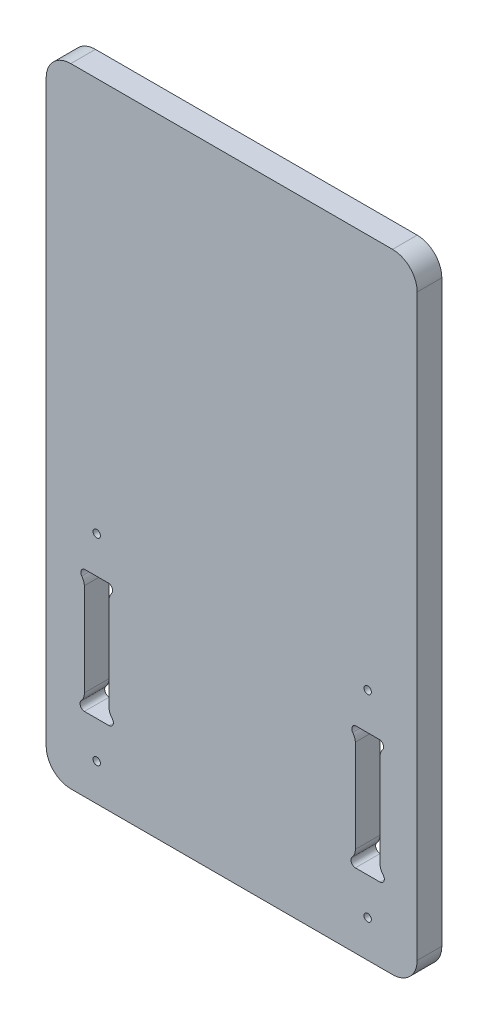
from build123d import *

# Parameters (mm, degrees)
ESQUISSE1_R        = 1.5
BOSS_EXTRU_1_DEPTH = 10
CHANFREIN1_SIZE    = 2.2


with BuildPart() as part:
    # Esquisse1 → Boss.-Extru.1 (new body)
    with BuildSketch(Plane.XY):
        with BuildLine():
            Line((-65.510099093, -55), (65.102145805, -55))
            ThreePointArc((65.102145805, -55), (72.173213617, -52.071067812), (75.102145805, -45))
            Line((75.102145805, -45), (75.102145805, 190))
            ThreePointArc((75.102145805, 190), (72.173213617, 197.071067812), (65.102145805, 200))
            Line((65.102145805, 200), (-65.510099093, 200))
            ThreePointArc((-65.510099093, 200), (-72.581166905, 197.071067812), (-75.510099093, 190))
            Line((-75.510099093, 190), (-75.510099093, -45))
            ThreePointArc((-75.510099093, -45), (-72.581166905, -52.071067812), (-65.510099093, -55))
        make_face()
        with Locations((-55, -40)):
            Circle(ESQUISSE1_R, mode=Mode.SUBTRACT)
        with Locations(Location((-55, 40, 0), (0, 0, 180))):
            Circle(ESQUISSE1_R, mode=Mode.SUBTRACT)
        with Locations(Location((55, -40, 0), (0, 0, 180))):
            Circle(ESQUISSE1_R, mode=Mode.SUBTRACT)
        with Locations((55, 40)):
            Circle(ESQUISSE1_R, mode=Mode.SUBTRACT)
        with BuildLine():
            Line((-50, -25), (-60, -25))
            ThreePointArc((-60, -25), (-61.589866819, -23.89973653), (-61.377923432, -21.977931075))
            ThreePointArc((-61.377923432, -21.977931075), (-60.356968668, -20.365420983), (-60, -18.490558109))
            Line((-60, -18.490558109), (-60, 19.198937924))
            ThreePointArc((-60, 19.198937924), (-60.312272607, 20.686227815), (-61.048762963, 22.015561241))
            ThreePointArc((-61.048762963, 22.015561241), (-61.333155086, 23.791992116), (-60, 25))
            Line((-60, 25), (-50, 25))
            ThreePointArc((-50, 25), (-48.666844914, 23.791992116), (-48.951237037, 22.015561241))
            ThreePointArc((-48.951237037, 22.015561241), (-49.687727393, 20.686227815), (-50, 19.198937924))
            Line((-50, 19.198937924), (-50, -18.490558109))
            ThreePointArc((-50, -18.490558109), (-49.643031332, -20.365420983), (-48.622076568, -21.977931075))
            ThreePointArc((-48.622076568, -21.977931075), (-48.410133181, -23.89973653), (-50, -25))
        make_face(mode=Mode.SUBTRACT)
        with BuildLine():
            Line((50, -18.490558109), (50, 19.198937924))
            ThreePointArc((50, 19.198937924), (49.687727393, 20.686227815), (48.951237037, 22.015561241))
            ThreePointArc((48.951237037, 22.015561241), (48.666844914, 23.791992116), (50, 25))
            Line((50, 25), (60, 25))
            ThreePointArc((60, 25), (61.333155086, 23.791992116), (61.048762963, 22.015561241))
            ThreePointArc((61.048762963, 22.015561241), (60.312272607, 20.686227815), (60, 19.198937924))
            Line((60, 19.198937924), (60, -18.490558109))
            ThreePointArc((60, -18.490558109), (60.356968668, -20.365420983), (61.377923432, -21.977931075))
            ThreePointArc((61.377923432, -21.977931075), (61.589866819, -23.89973653), (60, -25))
            Line((60, -25), (50, -25))
            ThreePointArc((50, -25), (48.410133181, -23.89973653), (48.622076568, -21.977931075))
            ThreePointArc((48.622076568, -21.977931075), (49.643031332, -20.365420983), (50, -18.490558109))
        make_face(mode=Mode.SUBTRACT)
    extrude(amount=BOSS_EXTRU_1_DEPTH)

    # Chanfrein1
    chanfrein1_edges = [part.edges().sort_by_distance(p)[0] for p in [
        (53.5, 40, 0),
        (-53.5, 40, 0),
        (-56.5, -40, 0),
        (56.5, -40, 0),
    ]]
    chamfer(chanfrein1_edges, length=CHANFREIN1_SIZE)


solid = part.part
